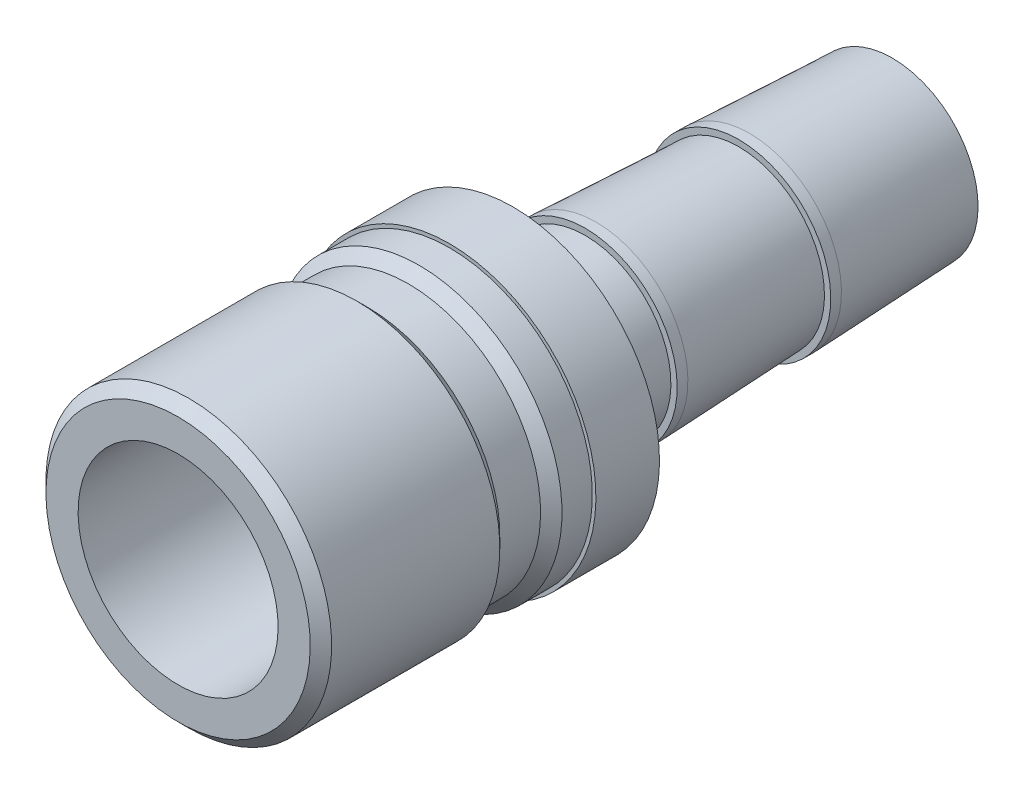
ISO-10303-21;
HEADER;
FILE_DESCRIPTION(('STEP AP214'),'2;1');
FILE_NAME('part.step','',(''),(''),'','','');
FILE_SCHEMA(('AUTOMOTIVE_DESIGN { 1 0 10303 214 1 1 1 1 }'));
ENDSEC;
DATA;
#1=APPLICATION_CONTEXT('core data for automotive mechanical design processes');
#2=APPLICATION_PROTOCOL_DEFINITION('international standard','automotive_design',2000,#1);
#3=PRODUCT_CONTEXT('',#1,'mechanical');
#4=PRODUCT('Part','Part','',(#3));
#5=PRODUCT_RELATED_PRODUCT_CATEGORY('part','',(#4));
#6=PRODUCT_DEFINITION_FORMATION('','',#4);
#7=PRODUCT_DEFINITION_CONTEXT('part definition',#1,'design');
#8=PRODUCT_DEFINITION('design','',#6,#7);
#9=PRODUCT_DEFINITION_SHAPE('','',#8);
#10=(LENGTH_UNIT() NAMED_UNIT(*) SI_UNIT(.MILLI.,.METRE.));
#11=(NAMED_UNIT(*) PLANE_ANGLE_UNIT() SI_UNIT($,.RADIAN.));
#12=(NAMED_UNIT(*) SI_UNIT($,.STERADIAN.) SOLID_ANGLE_UNIT());
#13=UNCERTAINTY_MEASURE_WITH_UNIT(LENGTH_MEASURE(1.E-05),#10,'distance_accuracy_value','');
#14=(GEOMETRIC_REPRESENTATION_CONTEXT(3) GLOBAL_UNCERTAINTY_ASSIGNED_CONTEXT((#13)) GLOBAL_UNIT_ASSIGNED_CONTEXT((#10,
#11,#12)) REPRESENTATION_CONTEXT('',''));
#15=CARTESIAN_POINT('',(0.,0.,0.));
#16=DIRECTION('',(0.,0.,1.));
#17=DIRECTION('',(1.,0.,0.));
#18=AXIS2_PLACEMENT_3D('',#15,#16,#17);
#19=CARTESIAN_POINT('',(0.,0.,0.));
#20=DIRECTION('',(0.,0.,-1.));
#21=DIRECTION('',(0.,1.,0.));
#22=AXIS2_PLACEMENT_3D('',#19,#20,#21);
#23=CYLINDRICAL_SURFACE('',#22,6.5405);
#24=CARTESIAN_POINT('',(0.,0.,-9.65199999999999));
#25=DIRECTION('',(0.,0.,-1.));
#26=DIRECTION('',(0.,1.,0.));
#27=AXIS2_PLACEMENT_3D('',#24,#25,#26);
#28=CIRCLE('',#27,6.5405);
#29=CARTESIAN_POINT('',(0.,6.5405,-9.65199999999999));
#30=VERTEX_POINT('',#29);
#31=EDGE_CURVE('E10',#30,#30,#28,.T.);
#32=ORIENTED_EDGE('',*,*,#31,.T.);
#33=EDGE_LOOP('',(#32));
#34=FACE_BOUND('',#33,.T.);
#35=CARTESIAN_POINT('',(0.,0.,-10.414));
#36=DIRECTION('',(0.,0.,-1.));
#37=DIRECTION('',(0.,1.,0.));
#38=AXIS2_PLACEMENT_3D('',#35,#36,#37);
#39=CIRCLE('',#38,6.5405);
#40=CARTESIAN_POINT('',(0.,6.5405,-10.414));
#41=VERTEX_POINT('',#40);
#42=EDGE_CURVE('E100',#41,#41,#39,.T.);
#43=ORIENTED_EDGE('',*,*,#42,.F.);
#44=EDGE_LOOP('',(#43));
#45=FACE_BOUND('',#44,.T.);
#46=ADVANCED_FACE('F30',(#34,#45),#23,.T.);
#47=CARTESIAN_POINT('',(0.,6.096,-9.65199999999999));
#48=DIRECTION('',(0.,0.,1.));
#49=DIRECTION('',(0.,-1.,0.));
#50=AXIS2_PLACEMENT_3D('',#47,#48,#49);
#51=PLANE('',#50);
#52=CARTESIAN_POINT('',(0.,0.,-9.65199999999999));
#53=DIRECTION('',(0.,0.,-1.));
#54=DIRECTION('',(0.,1.,0.));
#55=AXIS2_PLACEMENT_3D('',#52,#53,#54);
#56=CIRCLE('',#55,6.096);
#57=CARTESIAN_POINT('',(0.,6.096,-9.65199999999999));
#58=VERTEX_POINT('',#57);
#59=EDGE_CURVE('E36',#58,#58,#56,.T.);
#60=ORIENTED_EDGE('',*,*,#59,.T.);
#61=EDGE_LOOP('',(#60));
#62=FACE_BOUND('',#61,.T.);
#63=ORIENTED_EDGE('',*,*,#31,.F.);
#64=EDGE_LOOP('',(#63));
#65=FACE_BOUND('',#64,.T.);
#66=ADVANCED_FACE('F108',(#62,#65),#51,.T.);
#67=CARTESIAN_POINT('',(0.,0.,0.));
#68=DIRECTION('',(0.,0.,-1.));
#69=DIRECTION('',(0.,1.,0.));
#70=AXIS2_PLACEMENT_3D('',#67,#68,#69);
#71=CYLINDRICAL_SURFACE('',#70,6.096);
#72=CARTESIAN_POINT('',(0.,0.,-7.36599999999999));
#73=DIRECTION('',(0.,0.,-1.));
#74=DIRECTION('',(0.,1.,0.));
#75=AXIS2_PLACEMENT_3D('',#72,#73,#74);
#76=CIRCLE('',#75,6.096);
#77=CARTESIAN_POINT('',(0.,6.096,-7.36599999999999));
#78=VERTEX_POINT('',#77);
#79=EDGE_CURVE('E40',#78,#78,#76,.T.);
#80=ORIENTED_EDGE('',*,*,#79,.T.);
#81=EDGE_LOOP('',(#80));
#82=FACE_BOUND('',#81,.T.);
#83=ORIENTED_EDGE('',*,*,#59,.F.);
#84=EDGE_LOOP('',(#83));
#85=FACE_BOUND('',#84,.T.);
#86=ADVANCED_FACE('F112',(#82,#85),#71,.T.);
#87=CARTESIAN_POINT('',(0.,0.,-7.36599999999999));
#88=DIRECTION('',(0.,0.,1.));
#89=DIRECTION('',(0.,-1.,0.));
#90=AXIS2_PLACEMENT_3D('',#87,#88,#89);
#91=CONICAL_SURFACE('',#90,6.096,0.154996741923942);
#92=CARTESIAN_POINT('',(0.,0.,-4.5212));
#93=DIRECTION('',(0.,0.,-1.));
#94=DIRECTION('',(0.,1.,0.));
#95=AXIS2_PLACEMENT_3D('',#92,#93,#94);
#96=CIRCLE('',#95,6.5405);
#97=CARTESIAN_POINT('',(0.,6.5405,-4.5212));
#98=VERTEX_POINT('',#97);
#99=EDGE_CURVE('E44',#98,#98,#96,.T.);
#100=ORIENTED_EDGE('',*,*,#99,.T.);
#101=EDGE_LOOP('',(#100));
#102=FACE_BOUND('',#101,.T.);
#103=ORIENTED_EDGE('',*,*,#79,.F.);
#104=EDGE_LOOP('',(#103));
#105=FACE_BOUND('',#104,.T.);
#106=ADVANCED_FACE('F116',(#102,#105),#91,.T.);
#107=CARTESIAN_POINT('',(0.,10.414,-4.5212));
#108=DIRECTION('',(0.,0.,-1.));
#109=DIRECTION('',(0.,1.,0.));
#110=AXIS2_PLACEMENT_3D('',#107,#108,#109);
#111=PLANE('',#110);
#112=CARTESIAN_POINT('',(0.,0.,-4.5212));
#113=DIRECTION('',(0.,0.,-1.));
#114=DIRECTION('',(0.,1.,0.));
#115=AXIS2_PLACEMENT_3D('',#112,#113,#114);
#116=CIRCLE('',#115,10.414);
#117=CARTESIAN_POINT('',(0.,10.414,-4.52119999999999));
#118=VERTEX_POINT('',#117);
#119=EDGE_CURVE('E49',#118,#118,#116,.T.);
#120=ORIENTED_EDGE('',*,*,#119,.T.);
#121=EDGE_LOOP('',(#120));
#122=FACE_BOUND('',#121,.T.);
#123=ORIENTED_EDGE('',*,*,#99,.F.);
#124=EDGE_LOOP('',(#123));
#125=FACE_BOUND('',#124,.T.);
#126=ADVANCED_FACE('F123',(#122,#125),#111,.T.);
#127=CARTESIAN_POINT('',(0.,0.,0.));
#128=DIRECTION('',(0.,0.,-1.));
#129=DIRECTION('',(0.,1.,0.));
#130=AXIS2_PLACEMENT_3D('',#127,#128,#129);
#131=CYLINDRICAL_SURFACE('',#130,10.414);
#132=CARTESIAN_POINT('',(0.,0.,0.));
#133=DIRECTION('',(0.,0.,-1.));
#134=DIRECTION('',(0.,1.,0.));
#135=AXIS2_PLACEMENT_3D('',#132,#133,#134);
#136=CIRCLE('',#135,10.414);
#137=CARTESIAN_POINT('',(0.,10.414,0.));
#138=VERTEX_POINT('',#137);
#139=EDGE_CURVE('E52',#138,#138,#136,.T.);
#140=ORIENTED_EDGE('',*,*,#139,.T.);
#141=EDGE_LOOP('',(#140));
#142=FACE_BOUND('',#141,.T.);
#143=ORIENTED_EDGE('',*,*,#119,.F.);
#144=EDGE_LOOP('',(#143));
#145=FACE_BOUND('',#144,.T.);
#146=ADVANCED_FACE('F127',(#142,#145),#131,.T.);
#147=CARTESIAN_POINT('',(0.,10.16,0.));
#148=DIRECTION('',(0.,0.,1.));
#149=DIRECTION('',(0.,-1.,0.));
#150=AXIS2_PLACEMENT_3D('',#147,#148,#149);
#151=PLANE('',#150);
#152=CARTESIAN_POINT('',(0.,0.,0.));
#153=DIRECTION('',(0.,0.,-1.));
#154=DIRECTION('',(0.,1.,0.));
#155=AXIS2_PLACEMENT_3D('',#152,#153,#154);
#156=CIRCLE('',#155,10.16);
#157=CARTESIAN_POINT('',(0.,10.16,0.));
#158=VERTEX_POINT('',#157);
#159=EDGE_CURVE('E55',#158,#158,#156,.T.);
#160=ORIENTED_EDGE('',*,*,#159,.T.);
#161=EDGE_LOOP('',(#160));
#162=FACE_BOUND('',#161,.T.);
#163=ORIENTED_EDGE('',*,*,#139,.F.);
#164=EDGE_LOOP('',(#163));
#165=FACE_BOUND('',#164,.T.);
#166=ADVANCED_FACE('F131',(#162,#165),#151,.T.);
#167=CARTESIAN_POINT('',(0.,0.,0.));
#168=DIRECTION('',(0.,0.,-1.));
#169=DIRECTION('',(0.,1.,0.));
#170=AXIS2_PLACEMENT_3D('',#167,#168,#169);
#171=CYLINDRICAL_SURFACE('',#170,10.16);
#172=CARTESIAN_POINT('',(0.,0.,2.159));
#173=DIRECTION('',(0.,0.,-1.));
#174=DIRECTION('',(0.,1.,0.));
#175=AXIS2_PLACEMENT_3D('',#172,#173,#174);
#176=CIRCLE('',#175,10.16);
#177=CARTESIAN_POINT('',(0.,10.16,2.159));
#178=VERTEX_POINT('',#177);
#179=EDGE_CURVE('E58',#178,#178,#176,.T.);
#180=ORIENTED_EDGE('',*,*,#179,.T.);
#181=EDGE_LOOP('',(#180));
#182=FACE_BOUND('',#181,.T.);
#183=ORIENTED_EDGE('',*,*,#159,.F.);
#184=EDGE_LOOP('',(#183));
#185=FACE_BOUND('',#184,.T.);
#186=ADVANCED_FACE('F135',(#182,#185),#171,.T.);
#187=CARTESIAN_POINT('',(0.,0.,2.159));
#188=DIRECTION('',(0.,0.,-1.));
#189=DIRECTION('',(0.,1.,0.));
#190=AXIS2_PLACEMENT_3D('',#187,#188,#189);
#191=CONICAL_SURFACE('',#190,10.16,0.785398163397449);
#192=CARTESIAN_POINT('',(0.,0.,2.921));
#193=DIRECTION('',(0.,0.,-1.));
#194=DIRECTION('',(0.,1.,0.));
#195=AXIS2_PLACEMENT_3D('',#192,#193,#194);
#196=CIRCLE('',#195,9.398);
#197=CARTESIAN_POINT('',(0.,9.398,2.921));
#198=VERTEX_POINT('',#197);
#199=EDGE_CURVE('E61',#198,#198,#196,.T.);
#200=ORIENTED_EDGE('',*,*,#199,.T.);
#201=EDGE_LOOP('',(#200));
#202=FACE_BOUND('',#201,.T.);
#203=ORIENTED_EDGE('',*,*,#179,.F.);
#204=EDGE_LOOP('',(#203));
#205=FACE_BOUND('',#204,.T.);
#206=ADVANCED_FACE('F139',(#202,#205),#191,.T.);
#207=CARTESIAN_POINT('',(0.,0.,0.));
#208=DIRECTION('',(0.,0.,-1.));
#209=DIRECTION('',(0.,1.,0.));
#210=AXIS2_PLACEMENT_3D('',#207,#208,#209);
#211=CYLINDRICAL_SURFACE('',#210,9.398);
#212=CARTESIAN_POINT('',(0.,0.,5.8166));
#213=DIRECTION('',(0.,0.,-1.));
#214=DIRECTION('',(0.,1.,0.));
#215=AXIS2_PLACEMENT_3D('',#212,#213,#214);
#216=CIRCLE('',#215,9.398);
#217=CARTESIAN_POINT('',(0.,9.398,5.8166));
#218=VERTEX_POINT('',#217);
#219=EDGE_CURVE('E64',#218,#218,#216,.T.);
#220=ORIENTED_EDGE('',*,*,#219,.T.);
#221=EDGE_LOOP('',(#220));
#222=FACE_BOUND('',#221,.T.);
#223=ORIENTED_EDGE('',*,*,#199,.F.);
#224=EDGE_LOOP('',(#223));
#225=FACE_BOUND('',#224,.T.);
#226=ADVANCED_FACE('F143',(#222,#225),#211,.T.);
#227=CARTESIAN_POINT('',(0.,0.,5.8166));
#228=DIRECTION('',(0.,0.,1.));
#229=DIRECTION('',(0.,-1.,0.));
#230=AXIS2_PLACEMENT_3D('',#227,#228,#229);
#231=CONICAL_SURFACE('',#230,9.398,0.785398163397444);
#232=CARTESIAN_POINT('',(0.,0.,6.5786));
#233=DIRECTION('',(0.,0.,-1.));
#234=DIRECTION('',(0.,1.,0.));
#235=AXIS2_PLACEMENT_3D('',#232,#233,#234);
#236=CIRCLE('',#235,10.16);
#237=CARTESIAN_POINT('',(0.,10.16,6.5786));
#238=VERTEX_POINT('',#237);
#239=EDGE_CURVE('E67',#238,#238,#236,.T.);
#240=ORIENTED_EDGE('',*,*,#239,.T.);
#241=EDGE_LOOP('',(#240));
#242=FACE_BOUND('',#241,.T.);
#243=ORIENTED_EDGE('',*,*,#219,.F.);
#244=EDGE_LOOP('',(#243));
#245=FACE_BOUND('',#244,.T.);
#246=ADVANCED_FACE('F147',(#242,#245),#231,.T.);
#247=CARTESIAN_POINT('',(0.,0.,0.));
#248=DIRECTION('',(0.,0.,-1.));
#249=DIRECTION('',(0.,1.,0.));
#250=AXIS2_PLACEMENT_3D('',#247,#248,#249);
#251=CYLINDRICAL_SURFACE('',#250,10.16);
#252=CARTESIAN_POINT('',(0.,0.,18.542));
#253=DIRECTION('',(0.,0.,-1.));
#254=DIRECTION('',(0.,1.,0.));
#255=AXIS2_PLACEMENT_3D('',#252,#253,#254);
#256=CIRCLE('',#255,10.16);
#257=CARTESIAN_POINT('',(0.,10.16,18.542));
#258=VERTEX_POINT('',#257);
#259=EDGE_CURVE('E70',#258,#258,#256,.T.);
#260=ORIENTED_EDGE('',*,*,#259,.T.);
#261=EDGE_LOOP('',(#260));
#262=FACE_BOUND('',#261,.T.);
#263=ORIENTED_EDGE('',*,*,#239,.F.);
#264=EDGE_LOOP('',(#263));
#265=FACE_BOUND('',#264,.T.);
#266=ADVANCED_FACE('F151',(#262,#265),#251,.T.);
#267=CARTESIAN_POINT('',(0.,0.,18.542));
#268=DIRECTION('',(0.,0.,-1.));
#269=DIRECTION('',(0.,1.,0.));
#270=AXIS2_PLACEMENT_3D('',#267,#268,#269);
#271=CONICAL_SURFACE('',#270,10.16,0.785398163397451);
#272=CARTESIAN_POINT('',(0.,0.,19.304));
#273=DIRECTION('',(0.,0.,-1.));
#274=DIRECTION('',(0.,1.,0.));
#275=AXIS2_PLACEMENT_3D('',#272,#273,#274);
#276=CIRCLE('',#275,9.398);
#277=CARTESIAN_POINT('',(0.,9.398,19.304));
#278=VERTEX_POINT('',#277);
#279=EDGE_CURVE('E73',#278,#278,#276,.T.);
#280=ORIENTED_EDGE('',*,*,#279,.T.);
#281=EDGE_LOOP('',(#280));
#282=FACE_BOUND('',#281,.T.);
#283=ORIENTED_EDGE('',*,*,#259,.F.);
#284=EDGE_LOOP('',(#283));
#285=FACE_BOUND('',#284,.T.);
#286=ADVANCED_FACE('F155',(#282,#285),#271,.T.);
#287=CARTESIAN_POINT('',(0.,7.112,19.304));
#288=DIRECTION('',(0.,0.,1.));
#289=DIRECTION('',(0.,-1.,0.));
#290=AXIS2_PLACEMENT_3D('',#287,#288,#289);
#291=PLANE('',#290);
#292=CARTESIAN_POINT('',(0.,0.,19.304));
#293=DIRECTION('',(0.,0.,-1.));
#294=DIRECTION('',(0.,1.,0.));
#295=AXIS2_PLACEMENT_3D('',#292,#293,#294);
#296=CIRCLE('',#295,7.112);
#297=CARTESIAN_POINT('',(0.,7.112,19.304));
#298=VERTEX_POINT('',#297);
#299=EDGE_CURVE('E76',#298,#298,#296,.T.);
#300=ORIENTED_EDGE('',*,*,#299,.T.);
#301=EDGE_LOOP('',(#300));
#302=FACE_BOUND('',#301,.T.);
#303=ORIENTED_EDGE('',*,*,#279,.F.);
#304=EDGE_LOOP('',(#303));
#305=FACE_BOUND('',#304,.T.);
#306=ADVANCED_FACE('F159',(#302,#305),#291,.T.);
#307=CARTESIAN_POINT('',(0.,0.,0.));
#308=DIRECTION('',(0.,0.,-1.));
#309=DIRECTION('',(0.,1.,0.));
#310=AXIS2_PLACEMENT_3D('',#307,#308,#309);
#311=CYLINDRICAL_SURFACE('',#310,7.112);
#312=CARTESIAN_POINT('',(0.,0.,4.699));
#313=DIRECTION('',(0.,0.,-1.));
#314=DIRECTION('',(0.,1.,0.));
#315=AXIS2_PLACEMENT_3D('',#312,#313,#314);
#316=CIRCLE('',#315,7.112);
#317=CARTESIAN_POINT('',(0.,7.112,4.699));
#318=VERTEX_POINT('',#317);
#319=EDGE_CURVE('E79',#318,#318,#316,.T.);
#320=ORIENTED_EDGE('',*,*,#319,.T.);
#321=EDGE_LOOP('',(#320));
#322=FACE_BOUND('',#321,.T.);
#323=ORIENTED_EDGE('',*,*,#299,.F.);
#324=EDGE_LOOP('',(#323));
#325=FACE_BOUND('',#324,.T.);
#326=ADVANCED_FACE('F163',(#322,#325),#311,.F.);
#327=CARTESIAN_POINT('',(0.,0.,4.699));
#328=DIRECTION('',(0.,0.,1.));
#329=DIRECTION('',(0.,-1.,0.));
#330=AXIS2_PLACEMENT_3D('',#327,#328,#329);
#331=CONICAL_SURFACE('',#330,7.112,1.08210413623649);
#332=CARTESIAN_POINT('',(0.,0.,3.66077087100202));
#333=DIRECTION('',(0.,0.,-1.));
#334=DIRECTION('',(0.,1.,0.));
#335=AXIS2_PLACEMENT_3D('',#332,#333,#334);
#336=CIRCLE('',#335,5.159375);
#337=CARTESIAN_POINT('',(0.,5.159375,3.66077087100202));
#338=VERTEX_POINT('',#337);
#339=EDGE_CURVE('E82',#338,#338,#336,.T.);
#340=ORIENTED_EDGE('',*,*,#339,.T.);
#341=EDGE_LOOP('',(#340));
#342=FACE_BOUND('',#341,.T.);
#343=ORIENTED_EDGE('',*,*,#319,.F.);
#344=EDGE_LOOP('',(#343));
#345=FACE_BOUND('',#344,.T.);
#346=ADVANCED_FACE('F167',(#342,#345),#331,.F.);
#347=CARTESIAN_POINT('',(0.,0.,0.));
#348=DIRECTION('',(0.,0.,-1.));
#349=DIRECTION('',(0.,1.,0.));
#350=AXIS2_PLACEMENT_3D('',#347,#348,#349);
#351=CYLINDRICAL_SURFACE('',#350,5.159375);
#352=CARTESIAN_POINT('',(0.,0.,-31.496));
#353=DIRECTION('',(0.,0.,-1.));
#354=DIRECTION('',(0.,1.,0.));
#355=AXIS2_PLACEMENT_3D('',#352,#353,#354);
#356=CIRCLE('',#355,5.159375);
#357=CARTESIAN_POINT('',(0.,5.159375,-31.496));
#358=VERTEX_POINT('',#357);
#359=EDGE_CURVE('E85',#358,#358,#356,.T.);
#360=ORIENTED_EDGE('',*,*,#359,.T.);
#361=EDGE_LOOP('',(#360));
#362=FACE_BOUND('',#361,.T.);
#363=ORIENTED_EDGE('',*,*,#339,.F.);
#364=EDGE_LOOP('',(#363));
#365=FACE_BOUND('',#364,.T.);
#366=ADVANCED_FACE('F171',(#362,#365),#351,.F.);
#367=CARTESIAN_POINT('',(0.,6.096,-31.496));
#368=DIRECTION('',(0.,0.,-1.));
#369=DIRECTION('',(0.,1.,0.));
#370=AXIS2_PLACEMENT_3D('',#367,#368,#369);
#371=PLANE('',#370);
#372=CARTESIAN_POINT('',(0.,0.,-31.496));
#373=DIRECTION('',(0.,0.,-1.));
#374=DIRECTION('',(0.,1.,0.));
#375=AXIS2_PLACEMENT_3D('',#372,#373,#374);
#376=CIRCLE('',#375,6.09599999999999);
#377=CARTESIAN_POINT('',(0.,6.096,-31.496));
#378=VERTEX_POINT('',#377);
#379=EDGE_CURVE('E88',#378,#378,#376,.T.);
#380=ORIENTED_EDGE('',*,*,#379,.T.);
#381=EDGE_LOOP('',(#380));
#382=FACE_BOUND('',#381,.T.);
#383=ORIENTED_EDGE('',*,*,#359,.F.);
#384=EDGE_LOOP('',(#383));
#385=FACE_BOUND('',#384,.T.);
#386=ADVANCED_FACE('F175',(#382,#385),#371,.T.);
#387=CARTESIAN_POINT('',(0.,0.,-31.496));
#388=DIRECTION('',(0.,0.,1.));
#389=DIRECTION('',(0.,-1.,0.));
#390=AXIS2_PLACEMENT_3D('',#387,#388,#389);
#391=CONICAL_SURFACE('',#390,6.09599999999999,0.0437221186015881);
#392=CARTESIAN_POINT('',(0.,0.,-21.336));
#393=DIRECTION('',(0.,0.,-1.));
#394=DIRECTION('',(0.,1.,0.));
#395=AXIS2_PLACEMENT_3D('',#392,#393,#394);
#396=CIRCLE('',#395,6.5405);
#397=CARTESIAN_POINT('',(0.,6.5405,-21.336));
#398=VERTEX_POINT('',#397);
#399=EDGE_CURVE('E91',#398,#398,#396,.T.);
#400=ORIENTED_EDGE('',*,*,#399,.T.);
#401=EDGE_LOOP('',(#400));
#402=FACE_BOUND('',#401,.T.);
#403=ORIENTED_EDGE('',*,*,#379,.F.);
#404=EDGE_LOOP('',(#403));
#405=FACE_BOUND('',#404,.T.);
#406=ADVANCED_FACE('F179',(#402,#405),#391,.T.);
#407=CARTESIAN_POINT('',(0.,0.,0.));
#408=DIRECTION('',(0.,0.,-1.));
#409=DIRECTION('',(0.,1.,0.));
#410=AXIS2_PLACEMENT_3D('',#407,#408,#409);
#411=CYLINDRICAL_SURFACE('',#410,6.5405);
#412=CARTESIAN_POINT('',(0.,0.,-20.574));
#413=DIRECTION('',(0.,0.,-1.));
#414=DIRECTION('',(0.,1.,0.));
#415=AXIS2_PLACEMENT_3D('',#412,#413,#414);
#416=CIRCLE('',#415,6.5405);
#417=CARTESIAN_POINT('',(0.,6.5405,-20.574));
#418=VERTEX_POINT('',#417);
#419=EDGE_CURVE('E94',#418,#418,#416,.T.);
#420=ORIENTED_EDGE('',*,*,#419,.T.);
#421=EDGE_LOOP('',(#420));
#422=FACE_BOUND('',#421,.T.);
#423=ORIENTED_EDGE('',*,*,#399,.F.);
#424=EDGE_LOOP('',(#423));
#425=FACE_BOUND('',#424,.T.);
#426=ADVANCED_FACE('F183',(#422,#425),#411,.T.);
#427=CARTESIAN_POINT('',(0.,6.096,-20.574));
#428=DIRECTION('',(0.,0.,1.));
#429=DIRECTION('',(0.,-1.,0.));
#430=AXIS2_PLACEMENT_3D('',#427,#428,#429);
#431=PLANE('',#430);
#432=CARTESIAN_POINT('',(0.,0.,-20.574));
#433=DIRECTION('',(0.,0.,-1.));
#434=DIRECTION('',(0.,1.,0.));
#435=AXIS2_PLACEMENT_3D('',#432,#433,#434);
#436=CIRCLE('',#435,6.096);
#437=CARTESIAN_POINT('',(0.,6.096,-20.574));
#438=VERTEX_POINT('',#437);
#439=EDGE_CURVE('E97',#438,#438,#436,.T.);
#440=ORIENTED_EDGE('',*,*,#439,.T.);
#441=EDGE_LOOP('',(#440));
#442=FACE_BOUND('',#441,.T.);
#443=ORIENTED_EDGE('',*,*,#419,.F.);
#444=EDGE_LOOP('',(#443));
#445=FACE_BOUND('',#444,.T.);
#446=ADVANCED_FACE('F187',(#442,#445),#431,.T.);
#447=CARTESIAN_POINT('',(0.,0.,-20.574));
#448=DIRECTION('',(0.,0.,1.));
#449=DIRECTION('',(0.,-1.,0.));
#450=AXIS2_PLACEMENT_3D('',#447,#448,#449);
#451=CONICAL_SURFACE('',#450,6.096,0.043722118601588);
#452=ORIENTED_EDGE('',*,*,#42,.T.);
#453=EDGE_LOOP('',(#452));
#454=FACE_BOUND('',#453,.T.);
#455=ORIENTED_EDGE('',*,*,#439,.F.);
#456=EDGE_LOOP('',(#455));
#457=FACE_BOUND('',#456,.T.);
#458=ADVANCED_FACE('F104',(#454,#457),#451,.T.);
#459=CLOSED_SHELL('',(#46,#66,#86,#106,#126,#146,#166,#186,#206,#226,#246,#266,#286,#306,#326,
#346,#366,#386,#406,#426,#446,#458));
#460=MANIFOLD_SOLID_BREP('B2',#459);
#461=ADVANCED_BREP_SHAPE_REPRESENTATION('',(#18,#460),#14);
#462=SHAPE_DEFINITION_REPRESENTATION(#9,#461);
ENDSEC;
END-ISO-10303-21;
